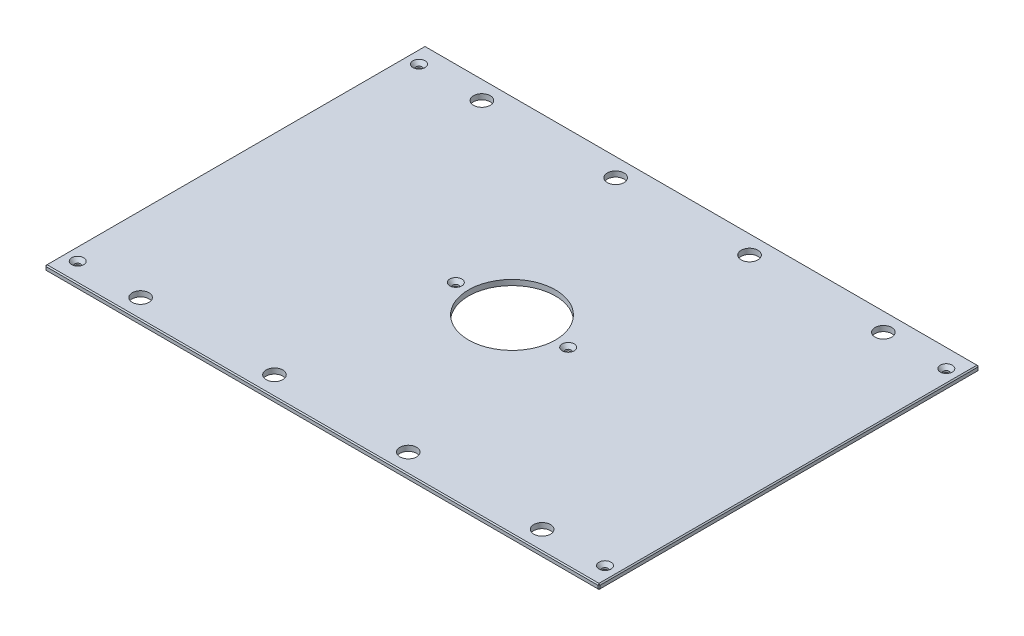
ISO-10303-21;
HEADER;
FILE_DESCRIPTION(('STEP AP214'),'2;1');
FILE_NAME('part.step','',(''),(''),'','','');
FILE_SCHEMA(('AUTOMOTIVE_DESIGN { 1 0 10303 214 1 1 1 1 }'));
ENDSEC;
DATA;
#1=APPLICATION_CONTEXT('core data for automotive mechanical design processes');
#2=APPLICATION_PROTOCOL_DEFINITION('international standard','automotive_design',2000,#1);
#3=PRODUCT_CONTEXT('',#1,'mechanical');
#4=PRODUCT('Part','Part','',(#3));
#5=PRODUCT_RELATED_PRODUCT_CATEGORY('part','',(#4));
#6=PRODUCT_DEFINITION_FORMATION('','',#4);
#7=PRODUCT_DEFINITION_CONTEXT('part definition',#1,'design');
#8=PRODUCT_DEFINITION('design','',#6,#7);
#9=PRODUCT_DEFINITION_SHAPE('','',#8);
#10=(LENGTH_UNIT() NAMED_UNIT(*) SI_UNIT(.MILLI.,.METRE.));
#11=(NAMED_UNIT(*) PLANE_ANGLE_UNIT() SI_UNIT($,.RADIAN.));
#12=(NAMED_UNIT(*) SI_UNIT($,.STERADIAN.) SOLID_ANGLE_UNIT());
#13=UNCERTAINTY_MEASURE_WITH_UNIT(LENGTH_MEASURE(1.E-05),#10,'distance_accuracy_value','');
#14=(GEOMETRIC_REPRESENTATION_CONTEXT(3) GLOBAL_UNCERTAINTY_ASSIGNED_CONTEXT((#13)) GLOBAL_UNIT_ASSIGNED_CONTEXT((#10,
#11,#12)) REPRESENTATION_CONTEXT('',''));
#15=CARTESIAN_POINT('',(0.,0.,0.));
#16=DIRECTION('',(0.,0.,1.));
#17=DIRECTION('',(1.,0.,0.));
#18=AXIS2_PLACEMENT_3D('',#15,#16,#17);
#19=CARTESIAN_POINT('',(-328.6125,6.35,-225.425));
#20=DIRECTION('',(1.,0.,0.));
#21=DIRECTION('',(0.,0.,-1.));
#22=AXIS2_PLACEMENT_3D('',#19,#20,#21);
#23=PLANE('',#22);
#24=DIRECTION('',(0.,0.,-1.));
#25=VECTOR('',#24,1.);
#26=CARTESIAN_POINT('',(-328.6125,5.08000000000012,-225.425));
#27=LINE('',#26,#25);
#28=CARTESIAN_POINT('',(-328.6125,5.08000000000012,224.155));
#29=VERTEX_POINT('',#28);
#30=CARTESIAN_POINT('',(-328.6125,5.08000000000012,-224.155));
#31=VERTEX_POINT('',#30);
#32=EDGE_CURVE('E135',#29,#31,#27,.T.);
#33=ORIENTED_EDGE('',*,*,#32,.T.);
#34=DIRECTION('',(0.,-1.,0.));
#35=VECTOR('',#34,1.);
#36=CARTESIAN_POINT('',(-328.6125,6.35,-224.155));
#37=LINE('',#36,#35);
#38=CARTESIAN_POINT('',(-328.6125,1.26999999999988,-224.155));
#39=VERTEX_POINT('',#38);
#40=EDGE_CURVE('E131',#31,#39,#37,.T.);
#41=ORIENTED_EDGE('',*,*,#40,.T.);
#42=DIRECTION('',(0.,0.,1.));
#43=VECTOR('',#42,1.);
#44=CARTESIAN_POINT('',(-328.6125,1.26999999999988,-225.425));
#45=LINE('',#44,#43);
#46=CARTESIAN_POINT('',(-328.6125,1.26999999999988,224.155));
#47=VERTEX_POINT('',#46);
#48=EDGE_CURVE('E126',#39,#47,#45,.T.);
#49=ORIENTED_EDGE('',*,*,#48,.T.);
#50=DIRECTION('',(0.,1.,0.));
#51=VECTOR('',#50,1.);
#52=CARTESIAN_POINT('',(-328.6125,6.35,224.155));
#53=LINE('',#52,#51);
#54=EDGE_CURVE('E128',#47,#29,#53,.T.);
#55=ORIENTED_EDGE('',*,*,#54,.T.);
#56=EDGE_LOOP('',(#33,#41,#49,#55));
#57=FACE_BOUND('',#56,.T.);
#58=ADVANCED_FACE('F35',(#57),#23,.F.);
#59=CARTESIAN_POINT('',(-328.6125,6.35,225.425));
#60=DIRECTION('',(0.,0.,-1.));
#61=DIRECTION('',(-1.,0.,0.));
#62=AXIS2_PLACEMENT_3D('',#59,#60,#61);
#63=PLANE('',#62);
#64=DIRECTION('',(1.,0.,0.));
#65=VECTOR('',#64,1.);
#66=CARTESIAN_POINT('',(-328.6125,1.26999999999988,225.425));
#67=LINE('',#66,#65);
#68=CARTESIAN_POINT('',(-327.3425,1.26999999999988,225.425));
#69=VERTEX_POINT('',#68);
#70=CARTESIAN_POINT('',(327.3425,1.26999999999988,225.425));
#71=VERTEX_POINT('',#70);
#72=EDGE_CURVE('E58',#69,#71,#67,.T.);
#73=ORIENTED_EDGE('',*,*,#72,.T.);
#74=DIRECTION('',(0.,1.,0.));
#75=VECTOR('',#74,1.);
#76=CARTESIAN_POINT('',(327.3425,6.35,225.425));
#77=LINE('',#76,#75);
#78=CARTESIAN_POINT('',(327.3425,5.08000000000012,225.425));
#79=VERTEX_POINT('',#78);
#80=EDGE_CURVE('E11',#71,#79,#77,.T.);
#81=ORIENTED_EDGE('',*,*,#80,.T.);
#82=DIRECTION('',(-1.,0.,0.));
#83=VECTOR('',#82,1.);
#84=CARTESIAN_POINT('',(-328.6125,5.08000000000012,225.425));
#85=LINE('',#84,#83);
#86=CARTESIAN_POINT('',(-327.3425,5.08000000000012,225.425));
#87=VERTEX_POINT('',#86);
#88=EDGE_CURVE('E44',#79,#87,#85,.T.);
#89=ORIENTED_EDGE('',*,*,#88,.T.);
#90=DIRECTION('',(0.,-1.,0.));
#91=VECTOR('',#90,1.);
#92=CARTESIAN_POINT('',(-327.3425,6.35,225.425));
#93=LINE('',#92,#91);
#94=EDGE_CURVE('E303',#87,#69,#93,.T.);
#95=ORIENTED_EDGE('',*,*,#94,.T.);
#96=EDGE_LOOP('',(#73,#81,#89,#95));
#97=FACE_BOUND('',#96,.T.);
#98=ADVANCED_FACE('F372',(#97),#63,.F.);
#99=CARTESIAN_POINT('',(328.6125,6.35,-225.425));
#100=DIRECTION('',(-1.,0.,0.));
#101=DIRECTION('',(0.,0.,1.));
#102=AXIS2_PLACEMENT_3D('',#99,#100,#101);
#103=PLANE('',#102);
#104=DIRECTION('',(0.,0.,-1.));
#105=VECTOR('',#104,1.);
#106=CARTESIAN_POINT('',(328.6125,1.26999999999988,-225.425));
#107=LINE('',#106,#105);
#108=CARTESIAN_POINT('',(328.6125,1.26999999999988,224.155));
#109=VERTEX_POINT('',#108);
#110=CARTESIAN_POINT('',(328.6125,1.26999999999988,-224.155));
#111=VERTEX_POINT('',#110);
#112=EDGE_CURVE('E298',#109,#111,#107,.T.);
#113=ORIENTED_EDGE('',*,*,#112,.T.);
#114=DIRECTION('',(0.,1.,0.));
#115=VECTOR('',#114,1.);
#116=CARTESIAN_POINT('',(328.6125,6.35,-224.155));
#117=LINE('',#116,#115);
#118=CARTESIAN_POINT('',(328.6125,5.08000000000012,-224.155));
#119=VERTEX_POINT('',#118);
#120=EDGE_CURVE('E300',#111,#119,#117,.T.);
#121=ORIENTED_EDGE('',*,*,#120,.T.);
#122=DIRECTION('',(0.,0.,1.));
#123=VECTOR('',#122,1.);
#124=CARTESIAN_POINT('',(328.6125,5.08000000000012,225.425));
#125=LINE('',#124,#123);
#126=CARTESIAN_POINT('',(328.6125,5.08000000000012,224.155));
#127=VERTEX_POINT('',#126);
#128=EDGE_CURVE('E296',#119,#127,#125,.T.);
#129=ORIENTED_EDGE('',*,*,#128,.T.);
#130=DIRECTION('',(0.,-1.,0.));
#131=VECTOR('',#130,1.);
#132=CARTESIAN_POINT('',(328.6125,6.35,224.155));
#133=LINE('',#132,#131);
#134=EDGE_CURVE('E294',#127,#109,#133,.T.);
#135=ORIENTED_EDGE('',*,*,#134,.T.);
#136=EDGE_LOOP('',(#113,#121,#129,#135));
#137=FACE_BOUND('',#136,.T.);
#138=ADVANCED_FACE('F359',(#137),#103,.F.);
#139=CARTESIAN_POINT('',(-328.6125,6.35,-225.425));
#140=DIRECTION('',(0.,0.,1.));
#141=DIRECTION('',(1.,0.,0.));
#142=AXIS2_PLACEMENT_3D('',#139,#140,#141);
#143=PLANE('',#142);
#144=DIRECTION('',(-1.,0.,0.));
#145=VECTOR('',#144,1.);
#146=CARTESIAN_POINT('',(-328.6125,1.26999999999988,-225.425));
#147=LINE('',#146,#145);
#148=CARTESIAN_POINT('',(327.3425,1.26999999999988,-225.425));
#149=VERTEX_POINT('',#148);
#150=CARTESIAN_POINT('',(-327.3425,1.26999999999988,-225.425));
#151=VERTEX_POINT('',#150);
#152=EDGE_CURVE('E270',#149,#151,#147,.T.);
#153=ORIENTED_EDGE('',*,*,#152,.T.);
#154=DIRECTION('',(0.,1.,0.));
#155=VECTOR('',#154,1.);
#156=CARTESIAN_POINT('',(-327.3425,6.35,-225.425));
#157=LINE('',#156,#155);
#158=CARTESIAN_POINT('',(-327.3425,5.08000000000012,-225.425));
#159=VERTEX_POINT('',#158);
#160=EDGE_CURVE('E274',#151,#159,#157,.T.);
#161=ORIENTED_EDGE('',*,*,#160,.T.);
#162=DIRECTION('',(1.,0.,0.));
#163=VECTOR('',#162,1.);
#164=CARTESIAN_POINT('',(328.6125,5.08000000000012,-225.425));
#165=LINE('',#164,#163);
#166=CARTESIAN_POINT('',(327.3425,5.08000000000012,-225.425));
#167=VERTEX_POINT('',#166);
#168=EDGE_CURVE('E272',#159,#167,#165,.T.);
#169=ORIENTED_EDGE('',*,*,#168,.T.);
#170=DIRECTION('',(0.,-1.,0.));
#171=VECTOR('',#170,1.);
#172=CARTESIAN_POINT('',(327.3425,6.35,-225.425));
#173=LINE('',#172,#171);
#174=EDGE_CURVE('E268',#167,#149,#173,.T.);
#175=ORIENTED_EDGE('',*,*,#174,.T.);
#176=EDGE_LOOP('',(#153,#161,#169,#175));
#177=FACE_BOUND('',#176,.T.);
#178=ADVANCED_FACE('F333',(#177),#143,.F.);
#179=CARTESIAN_POINT('',(0.,6.35,0.));
#180=DIRECTION('',(0.,1.,0.));
#181=DIRECTION('',(0.,0.,1.));
#182=AXIS2_PLACEMENT_3D('',#179,#180,#181);
#183=PLANE('',#182);
#184=CARTESIAN_POINT('',(312.7375,6.35,-202.40498));
#185=DIRECTION('',(0.,1.,0.));
#186=DIRECTION('',(0.,0.,1.));
#187=AXIS2_PLACEMENT_3D('',#184,#185,#186);
#188=CIRCLE('',#187,7.13740000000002);
#189=CARTESIAN_POINT('',(312.7375,6.35,-195.26758));
#190=VERTEX_POINT('',#189);
#191=EDGE_CURVE('E816',#190,#190,#188,.T.);
#192=ORIENTED_EDGE('',*,*,#191,.F.);
#193=EDGE_LOOP('',(#192));
#194=FACE_BOUND('',#193,.T.);
#195=CARTESIAN_POINT('',(312.7375,6.35,202.40498));
#196=DIRECTION('',(0.,1.,0.));
#197=DIRECTION('',(0.,0.,1.));
#198=AXIS2_PLACEMENT_3D('',#195,#196,#197);
#199=CIRCLE('',#198,7.13740000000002);
#200=CARTESIAN_POINT('',(312.7375,6.35,209.54238));
#201=VERTEX_POINT('',#200);
#202=EDGE_CURVE('E820',#201,#201,#199,.T.);
#203=ORIENTED_EDGE('',*,*,#202,.F.);
#204=EDGE_LOOP('',(#203));
#205=FACE_BOUND('',#204,.T.);
#206=CARTESIAN_POINT('',(-312.7375,6.35,202.40498));
#207=DIRECTION('',(0.,1.,0.));
#208=DIRECTION('',(0.,0.,1.));
#209=AXIS2_PLACEMENT_3D('',#206,#207,#208);
#210=CIRCLE('',#209,7.13740000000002);
#211=CARTESIAN_POINT('',(-312.7375,6.35,209.54238));
#212=VERTEX_POINT('',#211);
#213=EDGE_CURVE('E824',#212,#212,#210,.T.);
#214=ORIENTED_EDGE('',*,*,#213,.F.);
#215=EDGE_LOOP('',(#214));
#216=FACE_BOUND('',#215,.T.);
#217=CARTESIAN_POINT('',(-66.675,6.35,0.));
#218=DIRECTION('',(0.,1.,0.));
#219=DIRECTION('',(0.,0.,1.));
#220=AXIS2_PLACEMENT_3D('',#217,#218,#219);
#221=CIRCLE('',#220,7.1374);
#222=CARTESIAN_POINT('',(-66.675,6.35,7.1374));
#223=VERTEX_POINT('',#222);
#224=EDGE_CURVE('E828',#223,#223,#221,.T.);
#225=ORIENTED_EDGE('',*,*,#224,.F.);
#226=EDGE_LOOP('',(#225));
#227=FACE_BOUND('',#226,.T.);
#228=CARTESIAN_POINT('',(66.675,6.35,0.));
#229=DIRECTION('',(0.,1.,0.));
#230=DIRECTION('',(0.,0.,1.));
#231=AXIS2_PLACEMENT_3D('',#228,#229,#230);
#232=CIRCLE('',#231,7.1374);
#233=CARTESIAN_POINT('',(66.675,6.35,7.1374));
#234=VERTEX_POINT('',#233);
#235=EDGE_CURVE('E832',#234,#234,#232,.T.);
#236=ORIENTED_EDGE('',*,*,#235,.F.);
#237=EDGE_LOOP('',(#236));
#238=FACE_BOUND('',#237,.T.);
#239=CARTESIAN_POINT('',(-312.7375,6.35,-202.40498));
#240=DIRECTION('',(0.,1.,0.));
#241=DIRECTION('',(0.,0.,1.));
#242=AXIS2_PLACEMENT_3D('',#239,#240,#241);
#243=CIRCLE('',#242,7.13740000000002);
#244=CARTESIAN_POINT('',(-312.7375,6.35,-195.26758));
#245=VERTEX_POINT('',#244);
#246=EDGE_CURVE('E835',#245,#245,#243,.T.);
#247=ORIENTED_EDGE('',*,*,#246,.F.);
#248=EDGE_LOOP('',(#247));
#249=FACE_BOUND('',#248,.T.);
#250=DIRECTION('',(0.,0.,-1.));
#251=VECTOR('',#250,1.);
#252=CARTESIAN_POINT('',(327.3425,6.35,-225.425));
#253=LINE('',#252,#251);
#254=CARTESIAN_POINT('',(327.3425,6.35,224.155));
#255=VERTEX_POINT('',#254);
#256=CARTESIAN_POINT('',(327.3425,6.35,-224.155));
#257=VERTEX_POINT('',#256);
#258=EDGE_CURVE('E281',#255,#257,#253,.T.);
#259=ORIENTED_EDGE('',*,*,#258,.T.);
#260=DIRECTION('',(-1.,0.,0.));
#261=VECTOR('',#260,1.);
#262=CARTESIAN_POINT('',(-328.6125,6.35,-224.155));
#263=LINE('',#262,#261);
#264=CARTESIAN_POINT('',(-327.3425,6.35,-224.155));
#265=VERTEX_POINT('',#264);
#266=EDGE_CURVE('E283',#257,#265,#263,.T.);
#267=ORIENTED_EDGE('',*,*,#266,.T.);
#268=DIRECTION('',(0.,0.,1.));
#269=VECTOR('',#268,1.);
#270=CARTESIAN_POINT('',(-327.3425,6.35,225.425));
#271=LINE('',#270,#269);
#272=CARTESIAN_POINT('',(-327.3425,6.35,224.155));
#273=VERTEX_POINT('',#272);
#274=EDGE_CURVE('E279',#265,#273,#271,.T.);
#275=ORIENTED_EDGE('',*,*,#274,.T.);
#276=DIRECTION('',(1.,0.,0.));
#277=VECTOR('',#276,1.);
#278=CARTESIAN_POINT('',(328.6125,6.35,224.155));
#279=LINE('',#278,#277);
#280=EDGE_CURVE('E277',#273,#255,#279,.T.);
#281=ORIENTED_EDGE('',*,*,#280,.T.);
#282=EDGE_LOOP('',(#259,#267,#275,#281));
#283=FACE_BOUND('',#282,.T.);
#284=CARTESIAN_POINT('',(238.125,6.35,-202.40498));
#285=DIRECTION('',(0.,1.,0.));
#286=DIRECTION('',(0.,0.,1.));
#287=AXIS2_PLACEMENT_3D('',#284,#285,#286);
#288=CIRCLE('',#287,9.921875);
#289=CARTESIAN_POINT('',(238.125,6.35,-192.483105));
#290=VERTEX_POINT('',#289);
#291=EDGE_CURVE('E204',#290,#290,#288,.T.);
#292=ORIENTED_EDGE('',*,*,#291,.F.);
#293=EDGE_LOOP('',(#292));
#294=FACE_BOUND('',#293,.T.);
#295=CARTESIAN_POINT('',(-238.125,6.35,-202.40498));
#296=DIRECTION('',(0.,1.,0.));
#297=DIRECTION('',(0.,0.,1.));
#298=AXIS2_PLACEMENT_3D('',#295,#296,#297);
#299=CIRCLE('',#298,9.921875);
#300=CARTESIAN_POINT('',(-238.125,6.35,-192.483105));
#301=VERTEX_POINT('',#300);
#302=EDGE_CURVE('E214',#301,#301,#299,.T.);
#303=ORIENTED_EDGE('',*,*,#302,.F.);
#304=EDGE_LOOP('',(#303));
#305=FACE_BOUND('',#304,.T.);
#306=CARTESIAN_POINT('',(238.125,6.35,202.40498));
#307=DIRECTION('',(0.,1.,0.));
#308=DIRECTION('',(0.,0.,1.));
#309=AXIS2_PLACEMENT_3D('',#306,#307,#308);
#310=CIRCLE('',#309,9.921875);
#311=CARTESIAN_POINT('',(238.125,6.35,212.326855));
#312=VERTEX_POINT('',#311);
#313=EDGE_CURVE('E225',#312,#312,#310,.T.);
#314=ORIENTED_EDGE('',*,*,#313,.F.);
#315=EDGE_LOOP('',(#314));
#316=FACE_BOUND('',#315,.T.);
#317=CARTESIAN_POINT('',(-238.125,6.35,202.40498));
#318=DIRECTION('',(0.,1.,0.));
#319=DIRECTION('',(0.,0.,1.));
#320=AXIS2_PLACEMENT_3D('',#317,#318,#319);
#321=CIRCLE('',#320,9.921875);
#322=CARTESIAN_POINT('',(-238.125,6.35,212.326855));
#323=VERTEX_POINT('',#322);
#324=EDGE_CURVE('E231',#323,#323,#321,.T.);
#325=ORIENTED_EDGE('',*,*,#324,.F.);
#326=EDGE_LOOP('',(#325));
#327=FACE_BOUND('',#326,.T.);
#328=CARTESIAN_POINT('',(-79.375,6.35,-202.40498));
#329=DIRECTION('',(0.,1.,0.));
#330=DIRECTION('',(0.,0.,1.));
#331=AXIS2_PLACEMENT_3D('',#328,#329,#330);
#332=CIRCLE('',#331,9.921875);
#333=CARTESIAN_POINT('',(-79.375,6.35,-192.483105));
#334=VERTEX_POINT('',#333);
#335=EDGE_CURVE('E237',#334,#334,#332,.T.);
#336=ORIENTED_EDGE('',*,*,#335,.F.);
#337=EDGE_LOOP('',(#336));
#338=FACE_BOUND('',#337,.T.);
#339=CARTESIAN_POINT('',(79.375,6.35,-202.40498));
#340=DIRECTION('',(0.,1.,0.));
#341=DIRECTION('',(0.,0.,1.));
#342=AXIS2_PLACEMENT_3D('',#339,#340,#341);
#343=CIRCLE('',#342,9.921875);
#344=CARTESIAN_POINT('',(79.375,6.35,-192.483105));
#345=VERTEX_POINT('',#344);
#346=EDGE_CURVE('E243',#345,#345,#343,.T.);
#347=ORIENTED_EDGE('',*,*,#346,.F.);
#348=EDGE_LOOP('',(#347));
#349=FACE_BOUND('',#348,.T.);
#350=CARTESIAN_POINT('',(79.375,6.35,202.40498));
#351=DIRECTION('',(0.,1.,0.));
#352=DIRECTION('',(0.,0.,1.));
#353=AXIS2_PLACEMENT_3D('',#350,#351,#352);
#354=CIRCLE('',#353,9.921875);
#355=CARTESIAN_POINT('',(79.375,6.35,212.326855));
#356=VERTEX_POINT('',#355);
#357=EDGE_CURVE('E249',#356,#356,#354,.T.);
#358=ORIENTED_EDGE('',*,*,#357,.F.);
#359=EDGE_LOOP('',(#358));
#360=FACE_BOUND('',#359,.T.);
#361=CARTESIAN_POINT('',(-79.375,6.35,202.40498));
#362=DIRECTION('',(0.,1.,0.));
#363=DIRECTION('',(0.,0.,1.));
#364=AXIS2_PLACEMENT_3D('',#361,#362,#363);
#365=CIRCLE('',#364,9.921875);
#366=CARTESIAN_POINT('',(-79.375,6.35,212.326855));
#367=VERTEX_POINT('',#366);
#368=EDGE_CURVE('E255',#367,#367,#365,.T.);
#369=ORIENTED_EDGE('',*,*,#368,.F.);
#370=EDGE_LOOP('',(#369));
#371=FACE_BOUND('',#370,.T.);
#372=CARTESIAN_POINT('',(0.,6.35,0.));
#373=DIRECTION('',(0.,1.,0.));
#374=DIRECTION('',(0.,0.,1.));
#375=AXIS2_PLACEMENT_3D('',#372,#373,#374);
#376=CIRCLE('',#375,51.562);
#377=CARTESIAN_POINT('',(0.,6.35,51.562));
#378=VERTEX_POINT('',#377);
#379=EDGE_CURVE('E261',#378,#378,#376,.T.);
#380=ORIENTED_EDGE('',*,*,#379,.F.);
#381=EDGE_LOOP('',(#380));
#382=FACE_BOUND('',#381,.T.);
#383=ADVANCED_FACE('F381',(#194,#205,#216,#227,#238,#249,#283,#294,#305,#316,#327,#338,#349,
#360,#371,#382),#183,.T.);
#384=CARTESIAN_POINT('',(0.,0.,0.));
#385=DIRECTION('',(0.,1.,0.));
#386=DIRECTION('',(0.,0.,1.));
#387=AXIS2_PLACEMENT_3D('',#384,#385,#386);
#388=PLANE('',#387);
#389=CARTESIAN_POINT('',(312.7375,0.,-202.40498));
#390=DIRECTION('',(0.,1.,0.));
#391=DIRECTION('',(0.,0.,1.));
#392=AXIS2_PLACEMENT_3D('',#389,#390,#391);
#393=CIRCLE('',#392,3.3782);
#394=CARTESIAN_POINT('',(312.7375,0.,-199.02678));
#395=VERTEX_POINT('',#394);
#396=EDGE_CURVE('E869',#395,#395,#393,.T.);
#397=ORIENTED_EDGE('',*,*,#396,.T.);
#398=EDGE_LOOP('',(#397));
#399=FACE_BOUND('',#398,.T.);
#400=CARTESIAN_POINT('',(312.7375,0.,202.40498));
#401=DIRECTION('',(0.,1.,0.));
#402=DIRECTION('',(0.,0.,1.));
#403=AXIS2_PLACEMENT_3D('',#400,#401,#402);
#404=CIRCLE('',#403,3.3782);
#405=CARTESIAN_POINT('',(312.7375,0.,205.78318));
#406=VERTEX_POINT('',#405);
#407=EDGE_CURVE('E862',#406,#406,#404,.T.);
#408=ORIENTED_EDGE('',*,*,#407,.T.);
#409=EDGE_LOOP('',(#408));
#410=FACE_BOUND('',#409,.T.);
#411=CARTESIAN_POINT('',(-312.7375,0.,202.40498));
#412=DIRECTION('',(0.,1.,0.));
#413=DIRECTION('',(0.,0.,1.));
#414=AXIS2_PLACEMENT_3D('',#411,#412,#413);
#415=CIRCLE('',#414,3.3782);
#416=CARTESIAN_POINT('',(-312.7375,0.,205.78318));
#417=VERTEX_POINT('',#416);
#418=EDGE_CURVE('E855',#417,#417,#415,.T.);
#419=ORIENTED_EDGE('',*,*,#418,.T.);
#420=EDGE_LOOP('',(#419));
#421=FACE_BOUND('',#420,.T.);
#422=CARTESIAN_POINT('',(-66.675,0.,0.));
#423=DIRECTION('',(0.,1.,0.));
#424=DIRECTION('',(0.,0.,1.));
#425=AXIS2_PLACEMENT_3D('',#422,#423,#424);
#426=CIRCLE('',#425,3.3782);
#427=CARTESIAN_POINT('',(-66.675,0.,3.3782));
#428=VERTEX_POINT('',#427);
#429=EDGE_CURVE('E848',#428,#428,#426,.T.);
#430=ORIENTED_EDGE('',*,*,#429,.T.);
#431=EDGE_LOOP('',(#430));
#432=FACE_BOUND('',#431,.T.);
#433=CARTESIAN_POINT('',(66.675,0.,0.));
#434=DIRECTION('',(0.,1.,0.));
#435=DIRECTION('',(0.,0.,1.));
#436=AXIS2_PLACEMENT_3D('',#433,#434,#435);
#437=CIRCLE('',#436,3.3782);
#438=CARTESIAN_POINT('',(66.675,0.,3.3782));
#439=VERTEX_POINT('',#438);
#440=EDGE_CURVE('E838',#439,#439,#437,.T.);
#441=ORIENTED_EDGE('',*,*,#440,.T.);
#442=EDGE_LOOP('',(#441));
#443=FACE_BOUND('',#442,.T.);
#444=CARTESIAN_POINT('',(-312.7375,0.,-202.40498));
#445=DIRECTION('',(0.,1.,0.));
#446=DIRECTION('',(0.,0.,1.));
#447=AXIS2_PLACEMENT_3D('',#444,#445,#446);
#448=CIRCLE('',#447,3.3782);
#449=CARTESIAN_POINT('',(-312.7375,0.,-199.02678));
#450=VERTEX_POINT('',#449);
#451=EDGE_CURVE('E217',#450,#450,#448,.T.);
#452=ORIENTED_EDGE('',*,*,#451,.T.);
#453=EDGE_LOOP('',(#452));
#454=FACE_BOUND('',#453,.T.);
#455=DIRECTION('',(0.,0.,-1.));
#456=VECTOR('',#455,1.);
#457=CARTESIAN_POINT('',(-327.3425,0.,0.));
#458=LINE('',#457,#456);
#459=CARTESIAN_POINT('',(-327.3425,0.,224.155));
#460=VERTEX_POINT('',#459);
#461=CARTESIAN_POINT('',(-327.3425,0.,-224.155));
#462=VERTEX_POINT('',#461);
#463=EDGE_CURVE('E158',#460,#462,#458,.T.);
#464=ORIENTED_EDGE('',*,*,#463,.T.);
#465=DIRECTION('',(1.,0.,0.));
#466=VECTOR('',#465,1.);
#467=CARTESIAN_POINT('',(0.,0.,-224.155));
#468=LINE('',#467,#466);
#469=CARTESIAN_POINT('',(327.3425,0.,-224.155));
#470=VERTEX_POINT('',#469);
#471=EDGE_CURVE('E291',#462,#470,#468,.T.);
#472=ORIENTED_EDGE('',*,*,#471,.T.);
#473=DIRECTION('',(0.,0.,1.));
#474=VECTOR('',#473,1.);
#475=CARTESIAN_POINT('',(327.3425,0.,0.));
#476=LINE('',#475,#474);
#477=CARTESIAN_POINT('',(327.3425,0.,224.155));
#478=VERTEX_POINT('',#477);
#479=EDGE_CURVE('E289',#470,#478,#476,.T.);
#480=ORIENTED_EDGE('',*,*,#479,.T.);
#481=DIRECTION('',(-1.,0.,0.));
#482=VECTOR('',#481,1.);
#483=CARTESIAN_POINT('',(0.,0.,224.155));
#484=LINE('',#483,#482);
#485=EDGE_CURVE('E286',#478,#460,#484,.T.);
#486=ORIENTED_EDGE('',*,*,#485,.T.);
#487=EDGE_LOOP('',(#464,#472,#480,#486));
#488=FACE_BOUND('',#487,.T.);
#489=CARTESIAN_POINT('',(238.125,0.,-202.40498));
#490=DIRECTION('',(0.,1.,0.));
#491=DIRECTION('',(0.,0.,1.));
#492=AXIS2_PLACEMENT_3D('',#489,#490,#491);
#493=CIRCLE('',#492,9.921875);
#494=CARTESIAN_POINT('',(238.125,0.,-192.483105));
#495=VERTEX_POINT('',#494);
#496=EDGE_CURVE('E209',#495,#495,#493,.T.);
#497=ORIENTED_EDGE('',*,*,#496,.T.);
#498=EDGE_LOOP('',(#497));
#499=FACE_BOUND('',#498,.T.);
#500=CARTESIAN_POINT('',(-238.125,0.,-202.40498));
#501=DIRECTION('',(0.,1.,0.));
#502=DIRECTION('',(0.,0.,1.));
#503=AXIS2_PLACEMENT_3D('',#500,#501,#502);
#504=CIRCLE('',#503,9.921875);
#505=CARTESIAN_POINT('',(-238.125,0.,-192.483105));
#506=VERTEX_POINT('',#505);
#507=EDGE_CURVE('E222',#506,#506,#504,.T.);
#508=ORIENTED_EDGE('',*,*,#507,.T.);
#509=EDGE_LOOP('',(#508));
#510=FACE_BOUND('',#509,.T.);
#511=CARTESIAN_POINT('',(238.125,0.,202.40498));
#512=DIRECTION('',(0.,1.,0.));
#513=DIRECTION('',(0.,0.,1.));
#514=AXIS2_PLACEMENT_3D('',#511,#512,#513);
#515=CIRCLE('',#514,9.921875);
#516=CARTESIAN_POINT('',(238.125,0.,212.326855));
#517=VERTEX_POINT('',#516);
#518=EDGE_CURVE('E228',#517,#517,#515,.T.);
#519=ORIENTED_EDGE('',*,*,#518,.T.);
#520=EDGE_LOOP('',(#519));
#521=FACE_BOUND('',#520,.T.);
#522=CARTESIAN_POINT('',(-238.125,0.,202.40498));
#523=DIRECTION('',(0.,1.,0.));
#524=DIRECTION('',(0.,0.,1.));
#525=AXIS2_PLACEMENT_3D('',#522,#523,#524);
#526=CIRCLE('',#525,9.921875);
#527=CARTESIAN_POINT('',(-238.125,0.,212.326855));
#528=VERTEX_POINT('',#527);
#529=EDGE_CURVE('E234',#528,#528,#526,.T.);
#530=ORIENTED_EDGE('',*,*,#529,.T.);
#531=EDGE_LOOP('',(#530));
#532=FACE_BOUND('',#531,.T.);
#533=CARTESIAN_POINT('',(-79.375,0.,-202.40498));
#534=DIRECTION('',(0.,1.,0.));
#535=DIRECTION('',(0.,0.,1.));
#536=AXIS2_PLACEMENT_3D('',#533,#534,#535);
#537=CIRCLE('',#536,9.921875);
#538=CARTESIAN_POINT('',(-79.375,0.,-192.483105));
#539=VERTEX_POINT('',#538);
#540=EDGE_CURVE('E240',#539,#539,#537,.T.);
#541=ORIENTED_EDGE('',*,*,#540,.T.);
#542=EDGE_LOOP('',(#541));
#543=FACE_BOUND('',#542,.T.);
#544=CARTESIAN_POINT('',(79.375,0.,-202.40498));
#545=DIRECTION('',(0.,1.,0.));
#546=DIRECTION('',(0.,0.,1.));
#547=AXIS2_PLACEMENT_3D('',#544,#545,#546);
#548=CIRCLE('',#547,9.921875);
#549=CARTESIAN_POINT('',(79.375,0.,-192.483105));
#550=VERTEX_POINT('',#549);
#551=EDGE_CURVE('E246',#550,#550,#548,.T.);
#552=ORIENTED_EDGE('',*,*,#551,.T.);
#553=EDGE_LOOP('',(#552));
#554=FACE_BOUND('',#553,.T.);
#555=CARTESIAN_POINT('',(79.375,0.,202.40498));
#556=DIRECTION('',(0.,1.,0.));
#557=DIRECTION('',(0.,0.,1.));
#558=AXIS2_PLACEMENT_3D('',#555,#556,#557);
#559=CIRCLE('',#558,9.921875);
#560=CARTESIAN_POINT('',(79.375,0.,212.326855));
#561=VERTEX_POINT('',#560);
#562=EDGE_CURVE('E252',#561,#561,#559,.T.);
#563=ORIENTED_EDGE('',*,*,#562,.T.);
#564=EDGE_LOOP('',(#563));
#565=FACE_BOUND('',#564,.T.);
#566=CARTESIAN_POINT('',(-79.375,0.,202.40498));
#567=DIRECTION('',(0.,1.,0.));
#568=DIRECTION('',(0.,0.,1.));
#569=AXIS2_PLACEMENT_3D('',#566,#567,#568);
#570=CIRCLE('',#569,9.921875);
#571=CARTESIAN_POINT('',(-79.375,0.,212.326855));
#572=VERTEX_POINT('',#571);
#573=EDGE_CURVE('E258',#572,#572,#570,.T.);
#574=ORIENTED_EDGE('',*,*,#573,.T.);
#575=EDGE_LOOP('',(#574));
#576=FACE_BOUND('',#575,.T.);
#577=CARTESIAN_POINT('',(0.,0.,0.));
#578=DIRECTION('',(0.,1.,0.));
#579=DIRECTION('',(0.,0.,1.));
#580=AXIS2_PLACEMENT_3D('',#577,#578,#579);
#581=CIRCLE('',#580,51.562);
#582=CARTESIAN_POINT('',(0.,0.,51.562));
#583=VERTEX_POINT('',#582);
#584=EDGE_CURVE('E147',#583,#583,#581,.T.);
#585=ORIENTED_EDGE('',*,*,#584,.T.);
#586=EDGE_LOOP('',(#585));
#587=FACE_BOUND('',#586,.T.);
#588=ADVANCED_FACE('F346',(#399,#410,#421,#432,#443,#454,#488,#499,#510,#521,#532,#543,#554,
#565,#576,#587),#388,.F.);
#589=CARTESIAN_POINT('',(0.,0.,0.));
#590=DIRECTION('',(0.,1.,0.));
#591=DIRECTION('',(0.,0.,1.));
#592=AXIS2_PLACEMENT_3D('',#589,#590,#591);
#593=CYLINDRICAL_SURFACE('',#592,51.562);
#594=ORIENTED_EDGE('',*,*,#584,.F.);
#595=EDGE_LOOP('',(#594));
#596=FACE_BOUND('',#595,.T.);
#597=ORIENTED_EDGE('',*,*,#379,.T.);
#598=EDGE_LOOP('',(#597));
#599=FACE_BOUND('',#598,.T.);
#600=ADVANCED_FACE('F751',(#596,#599),#593,.F.);
#601=CARTESIAN_POINT('',(-79.375,6.35,202.40498));
#602=DIRECTION('',(0.,1.,0.));
#603=DIRECTION('',(0.,0.,1.));
#604=AXIS2_PLACEMENT_3D('',#601,#602,#603);
#605=CYLINDRICAL_SURFACE('',#604,9.921875);
#606=ORIENTED_EDGE('',*,*,#573,.F.);
#607=EDGE_LOOP('',(#606));
#608=FACE_BOUND('',#607,.T.);
#609=ORIENTED_EDGE('',*,*,#368,.T.);
#610=EDGE_LOOP('',(#609));
#611=FACE_BOUND('',#610,.T.);
#612=ADVANCED_FACE('F742',(#608,#611),#605,.F.);
#613=CARTESIAN_POINT('',(79.375,6.35,202.40498));
#614=DIRECTION('',(0.,1.,0.));
#615=DIRECTION('',(0.,0.,1.));
#616=AXIS2_PLACEMENT_3D('',#613,#614,#615);
#617=CYLINDRICAL_SURFACE('',#616,9.921875);
#618=ORIENTED_EDGE('',*,*,#562,.F.);
#619=EDGE_LOOP('',(#618));
#620=FACE_BOUND('',#619,.T.);
#621=ORIENTED_EDGE('',*,*,#357,.T.);
#622=EDGE_LOOP('',(#621));
#623=FACE_BOUND('',#622,.T.);
#624=ADVANCED_FACE('F733',(#620,#623),#617,.F.);
#625=CARTESIAN_POINT('',(79.375,6.35,-202.40498));
#626=DIRECTION('',(0.,1.,0.));
#627=DIRECTION('',(0.,0.,1.));
#628=AXIS2_PLACEMENT_3D('',#625,#626,#627);
#629=CYLINDRICAL_SURFACE('',#628,9.921875);
#630=ORIENTED_EDGE('',*,*,#551,.F.);
#631=EDGE_LOOP('',(#630));
#632=FACE_BOUND('',#631,.T.);
#633=ORIENTED_EDGE('',*,*,#346,.T.);
#634=EDGE_LOOP('',(#633));
#635=FACE_BOUND('',#634,.T.);
#636=ADVANCED_FACE('F724',(#632,#635),#629,.F.);
#637=CARTESIAN_POINT('',(-79.375,6.35,-202.40498));
#638=DIRECTION('',(0.,1.,0.));
#639=DIRECTION('',(0.,0.,1.));
#640=AXIS2_PLACEMENT_3D('',#637,#638,#639);
#641=CYLINDRICAL_SURFACE('',#640,9.921875);
#642=ORIENTED_EDGE('',*,*,#540,.F.);
#643=EDGE_LOOP('',(#642));
#644=FACE_BOUND('',#643,.T.);
#645=ORIENTED_EDGE('',*,*,#335,.T.);
#646=EDGE_LOOP('',(#645));
#647=FACE_BOUND('',#646,.T.);
#648=ADVANCED_FACE('F715',(#644,#647),#641,.F.);
#649=CARTESIAN_POINT('',(-238.125,6.35,202.40498));
#650=DIRECTION('',(0.,1.,0.));
#651=DIRECTION('',(0.,0.,1.));
#652=AXIS2_PLACEMENT_3D('',#649,#650,#651);
#653=CYLINDRICAL_SURFACE('',#652,9.921875);
#654=ORIENTED_EDGE('',*,*,#529,.F.);
#655=EDGE_LOOP('',(#654));
#656=FACE_BOUND('',#655,.T.);
#657=ORIENTED_EDGE('',*,*,#324,.T.);
#658=EDGE_LOOP('',(#657));
#659=FACE_BOUND('',#658,.T.);
#660=ADVANCED_FACE('F706',(#656,#659),#653,.F.);
#661=CARTESIAN_POINT('',(238.125,6.35,202.40498));
#662=DIRECTION('',(0.,1.,0.));
#663=DIRECTION('',(0.,0.,1.));
#664=AXIS2_PLACEMENT_3D('',#661,#662,#663);
#665=CYLINDRICAL_SURFACE('',#664,9.921875);
#666=ORIENTED_EDGE('',*,*,#518,.F.);
#667=EDGE_LOOP('',(#666));
#668=FACE_BOUND('',#667,.T.);
#669=ORIENTED_EDGE('',*,*,#313,.T.);
#670=EDGE_LOOP('',(#669));
#671=FACE_BOUND('',#670,.T.);
#672=ADVANCED_FACE('F697',(#668,#671),#665,.F.);
#673=CARTESIAN_POINT('',(-238.125,6.35,-202.40498));
#674=DIRECTION('',(0.,1.,0.));
#675=DIRECTION('',(0.,0.,1.));
#676=AXIS2_PLACEMENT_3D('',#673,#674,#675);
#677=CYLINDRICAL_SURFACE('',#676,9.921875);
#678=ORIENTED_EDGE('',*,*,#507,.F.);
#679=EDGE_LOOP('',(#678));
#680=FACE_BOUND('',#679,.T.);
#681=ORIENTED_EDGE('',*,*,#302,.T.);
#682=EDGE_LOOP('',(#681));
#683=FACE_BOUND('',#682,.T.);
#684=ADVANCED_FACE('F687',(#680,#683),#677,.F.);
#685=CARTESIAN_POINT('',(238.125,6.35,-202.40498));
#686=DIRECTION('',(0.,1.,0.));
#687=DIRECTION('',(0.,0.,1.));
#688=AXIS2_PLACEMENT_3D('',#685,#686,#687);
#689=CYLINDRICAL_SURFACE('',#688,9.921875);
#690=ORIENTED_EDGE('',*,*,#496,.F.);
#691=EDGE_LOOP('',(#690));
#692=FACE_BOUND('',#691,.T.);
#693=ORIENTED_EDGE('',*,*,#291,.T.);
#694=EDGE_LOOP('',(#693));
#695=FACE_BOUND('',#694,.T.);
#696=ADVANCED_FACE('F390',(#692,#695),#689,.F.);
#697=CARTESIAN_POINT('',(328.6125,6.35,224.155));
#698=DIRECTION('',(-0.707106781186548,0.,-0.707106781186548));
#699=DIRECTION('',(0.,-1.,0.));
#700=AXIS2_PLACEMENT_3D('',#697,#698,#699);
#701=PLANE('',#700);
#702=DIRECTION('',(-0.707106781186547,0.,0.707106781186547));
#703=VECTOR('',#702,1.);
#704=CARTESIAN_POINT('',(328.6125,5.08000000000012,224.155));
#705=LINE('',#704,#703);
#706=EDGE_CURVE('E39',#79,#127,#705,.F.);
#707=ORIENTED_EDGE('',*,*,#706,.F.);
#708=ORIENTED_EDGE('',*,*,#80,.F.);
#709=DIRECTION('',(0.707106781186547,0.,-0.707106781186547));
#710=VECTOR('',#709,1.);
#711=CARTESIAN_POINT('',(327.9775,1.26999999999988,224.79));
#712=LINE('',#711,#710);
#713=EDGE_CURVE('E197',#109,#71,#712,.F.);
#714=ORIENTED_EDGE('',*,*,#713,.F.);
#715=ORIENTED_EDGE('',*,*,#134,.F.);
#716=EDGE_LOOP('',(#707,#708,#714,#715));
#717=FACE_BOUND('',#716,.T.);
#718=ADVANCED_FACE('F37',(#717),#701,.F.);
#719=CARTESIAN_POINT('',(328.6125,5.08000000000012,224.155));
#720=DIRECTION('',(0.577350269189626,0.577350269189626,0.577350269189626));
#721=DIRECTION('',(0.707106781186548,0.,-0.707106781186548));
#722=AXIS2_PLACEMENT_3D('',#719,#720,#721);
#723=PLANE('',#722);
#724=DIRECTION('',(0.,-0.707106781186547,0.707106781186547));
#725=VECTOR('',#724,1.);
#726=CARTESIAN_POINT('',(327.3425,5.71500000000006,224.79));
#727=LINE('',#726,#725);
#728=EDGE_CURVE('E193',#79,#255,#727,.F.);
#729=ORIENTED_EDGE('',*,*,#728,.F.);
#730=ORIENTED_EDGE('',*,*,#706,.T.);
#731=DIRECTION('',(-0.707106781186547,0.707106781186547,0.));
#732=VECTOR('',#731,1.);
#733=CARTESIAN_POINT('',(328.6125,5.08000000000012,224.155));
#734=LINE('',#733,#732);
#735=EDGE_CURVE('E195',#255,#127,#734,.F.);
#736=ORIENTED_EDGE('',*,*,#735,.F.);
#737=EDGE_LOOP('',(#729,#730,#736));
#738=FACE_BOUND('',#737,.T.);
#739=ADVANCED_FACE('F383',(#738),#723,.T.);
#740=CARTESIAN_POINT('',(327.3425,0.,224.155));
#741=DIRECTION('',(0.577350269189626,-0.577350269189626,0.577350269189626));
#742=DIRECTION('',(0.707106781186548,0.,-0.707106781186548));
#743=AXIS2_PLACEMENT_3D('',#740,#741,#742);
#744=PLANE('',#743);
#745=DIRECTION('',(-0.707106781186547,-0.707106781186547,0.));
#746=VECTOR('',#745,1.);
#747=CARTESIAN_POINT('',(327.3425,0.,224.155));
#748=LINE('',#747,#746);
#749=EDGE_CURVE('E187',#109,#478,#748,.T.);
#750=ORIENTED_EDGE('',*,*,#749,.F.);
#751=ORIENTED_EDGE('',*,*,#713,.T.);
#752=DIRECTION('',(0.,0.707106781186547,0.707106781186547));
#753=VECTOR('',#752,1.);
#754=CARTESIAN_POINT('',(327.3425,0.,224.155));
#755=LINE('',#754,#753);
#756=EDGE_CURVE('E190',#478,#71,#755,.T.);
#757=ORIENTED_EDGE('',*,*,#756,.F.);
#758=EDGE_LOOP('',(#750,#751,#757));
#759=FACE_BOUND('',#758,.T.);
#760=ADVANCED_FACE('F352',(#759),#744,.T.);
#761=CARTESIAN_POINT('',(327.3425,6.35,0.));
#762=DIRECTION('',(0.707106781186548,0.707106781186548,0.));
#763=DIRECTION('',(0.,0.,1.));
#764=AXIS2_PLACEMENT_3D('',#761,#762,#763);
#765=PLANE('',#764);
#766=ORIENTED_EDGE('',*,*,#735,.T.);
#767=ORIENTED_EDGE('',*,*,#128,.F.);
#768=DIRECTION('',(0.707106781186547,-0.707106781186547,0.));
#769=VECTOR('',#768,1.);
#770=CARTESIAN_POINT('',(327.9775,5.71500000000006,-224.155));
#771=LINE('',#770,#769);
#772=EDGE_CURVE('E182',#257,#119,#771,.T.);
#773=ORIENTED_EDGE('',*,*,#772,.F.);
#774=ORIENTED_EDGE('',*,*,#258,.F.);
#775=EDGE_LOOP('',(#766,#767,#773,#774));
#776=FACE_BOUND('',#775,.T.);
#777=ADVANCED_FACE('F369',(#776),#765,.T.);
#778=CARTESIAN_POINT('',(0.,6.35,224.155));
#779=DIRECTION('',(0.,0.707106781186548,0.707106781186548));
#780=DIRECTION('',(-1.,0.,0.));
#781=AXIS2_PLACEMENT_3D('',#778,#779,#780);
#782=PLANE('',#781);
#783=ORIENTED_EDGE('',*,*,#728,.T.);
#784=ORIENTED_EDGE('',*,*,#280,.F.);
#785=DIRECTION('',(0.,0.707106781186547,-0.707106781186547));
#786=VECTOR('',#785,1.);
#787=CARTESIAN_POINT('',(-327.3425,6.35,224.155));
#788=LINE('',#787,#786);
#789=EDGE_CURVE('E179',#87,#273,#788,.T.);
#790=ORIENTED_EDGE('',*,*,#789,.F.);
#791=ORIENTED_EDGE('',*,*,#88,.F.);
#792=EDGE_LOOP('',(#783,#784,#790,#791));
#793=FACE_BOUND('',#792,.T.);
#794=ADVANCED_FACE('F374',(#793),#782,.T.);
#795=CARTESIAN_POINT('',(-327.3425,6.35,225.425));
#796=DIRECTION('',(0.707106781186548,0.,-0.707106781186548));
#797=DIRECTION('',(0.,-1.,0.));
#798=AXIS2_PLACEMENT_3D('',#795,#796,#797);
#799=PLANE('',#798);
#800=DIRECTION('',(0.707106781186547,0.,0.707106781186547));
#801=VECTOR('',#800,1.);
#802=CARTESIAN_POINT('',(-328.6125,1.26999999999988,224.155));
#803=LINE('',#802,#801);
#804=EDGE_CURVE('E142',#69,#47,#803,.F.);
#805=ORIENTED_EDGE('',*,*,#804,.F.);
#806=ORIENTED_EDGE('',*,*,#94,.F.);
#807=DIRECTION('',(-0.707106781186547,0.,-0.707106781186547));
#808=VECTOR('',#807,1.);
#809=CARTESIAN_POINT('',(-327.9775,5.08000000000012,224.79));
#810=LINE('',#809,#808);
#811=EDGE_CURVE('E145',#29,#87,#810,.F.);
#812=ORIENTED_EDGE('',*,*,#811,.F.);
#813=ORIENTED_EDGE('',*,*,#54,.F.);
#814=EDGE_LOOP('',(#805,#806,#812,#813));
#815=FACE_BOUND('',#814,.T.);
#816=ADVANCED_FACE('F140',(#815),#799,.F.);
#817=CARTESIAN_POINT('',(-328.6125,1.26999999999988,225.425));
#818=DIRECTION('',(0.,0.707106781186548,-0.707106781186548));
#819=DIRECTION('',(1.,0.,0.));
#820=AXIS2_PLACEMENT_3D('',#817,#818,#819);
#821=PLANE('',#820);
#822=ORIENTED_EDGE('',*,*,#756,.T.);
#823=ORIENTED_EDGE('',*,*,#72,.F.);
#824=DIRECTION('',(0.,-0.707106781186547,-0.707106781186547));
#825=VECTOR('',#824,1.);
#826=CARTESIAN_POINT('',(-327.3425,0.634999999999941,224.79));
#827=LINE('',#826,#825);
#828=EDGE_CURVE('E155',#460,#69,#827,.F.);
#829=ORIENTED_EDGE('',*,*,#828,.F.);
#830=ORIENTED_EDGE('',*,*,#485,.F.);
#831=EDGE_LOOP('',(#822,#823,#829,#830));
#832=FACE_BOUND('',#831,.T.);
#833=ADVANCED_FACE('F351',(#832),#821,.F.);
#834=CARTESIAN_POINT('',(328.6125,1.26999999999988,-225.425));
#835=DIRECTION('',(-0.707106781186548,0.707106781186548,0.));
#836=DIRECTION('',(0.,0.,-1.));
#837=AXIS2_PLACEMENT_3D('',#834,#835,#836);
#838=PLANE('',#837);
#839=ORIENTED_EDGE('',*,*,#749,.T.);
#840=ORIENTED_EDGE('',*,*,#479,.F.);
#841=DIRECTION('',(0.707106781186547,0.707106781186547,0.));
#842=VECTOR('',#841,1.);
#843=CARTESIAN_POINT('',(327.3425,0.,-224.155));
#844=LINE('',#843,#842);
#845=EDGE_CURVE('E174',#111,#470,#844,.F.);
#846=ORIENTED_EDGE('',*,*,#845,.F.);
#847=ORIENTED_EDGE('',*,*,#112,.F.);
#848=EDGE_LOOP('',(#839,#840,#846,#847));
#849=FACE_BOUND('',#848,.T.);
#850=ADVANCED_FACE('F356',(#849),#838,.F.);
#851=CARTESIAN_POINT('',(327.3425,6.35,-225.425));
#852=DIRECTION('',(-0.707106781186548,0.,0.707106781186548));
#853=DIRECTION('',(0.,-1.,0.));
#854=AXIS2_PLACEMENT_3D('',#851,#852,#853);
#855=PLANE('',#854);
#856=DIRECTION('',(0.707106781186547,0.,0.707106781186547));
#857=VECTOR('',#856,1.);
#858=CARTESIAN_POINT('',(327.3425,5.08000000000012,-225.425));
#859=LINE('',#858,#857);
#860=EDGE_CURVE('E184',#119,#167,#859,.F.);
#861=ORIENTED_EDGE('',*,*,#860,.F.);
#862=ORIENTED_EDGE('',*,*,#120,.F.);
#863=DIRECTION('',(-0.707106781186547,0.,-0.707106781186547));
#864=VECTOR('',#863,1.);
#865=CARTESIAN_POINT('',(327.9775,1.26999999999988,-224.79));
#866=LINE('',#865,#864);
#867=EDGE_CURVE('E171',#149,#111,#866,.F.);
#868=ORIENTED_EDGE('',*,*,#867,.F.);
#869=ORIENTED_EDGE('',*,*,#174,.F.);
#870=EDGE_LOOP('',(#861,#862,#868,#869));
#871=FACE_BOUND('',#870,.T.);
#872=ADVANCED_FACE('F364',(#871),#855,.F.);
#873=CARTESIAN_POINT('',(327.3425,5.08000000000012,-225.425));
#874=DIRECTION('',(0.577350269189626,0.577350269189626,-0.577350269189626));
#875=DIRECTION('',(-0.707106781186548,0.,-0.707106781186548));
#876=AXIS2_PLACEMENT_3D('',#873,#874,#875);
#877=PLANE('',#876);
#878=ORIENTED_EDGE('',*,*,#772,.T.);
#879=ORIENTED_EDGE('',*,*,#860,.T.);
#880=DIRECTION('',(0.,0.707106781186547,0.707106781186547));
#881=VECTOR('',#880,1.);
#882=CARTESIAN_POINT('',(327.3425,5.08000000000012,-225.425));
#883=LINE('',#882,#881);
#884=EDGE_CURVE('E163',#257,#167,#883,.F.);
#885=ORIENTED_EDGE('',*,*,#884,.F.);
#886=EDGE_LOOP('',(#878,#879,#885));
#887=FACE_BOUND('',#886,.T.);
#888=ADVANCED_FACE('F422',(#887),#877,.T.);
#889=CARTESIAN_POINT('',(-327.3425,6.35,224.155));
#890=DIRECTION('',(-0.577350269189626,0.577350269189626,0.577350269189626));
#891=DIRECTION('',(0.707106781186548,0.,0.707106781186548));
#892=AXIS2_PLACEMENT_3D('',#889,#890,#891);
#893=PLANE('',#892);
#894=ORIENTED_EDGE('',*,*,#811,.T.);
#895=ORIENTED_EDGE('',*,*,#789,.T.);
#896=DIRECTION('',(-0.707106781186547,-0.707106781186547,0.));
#897=VECTOR('',#896,1.);
#898=CARTESIAN_POINT('',(-327.3425,6.35,224.155));
#899=LINE('',#898,#897);
#900=EDGE_CURVE('E159',#29,#273,#899,.F.);
#901=ORIENTED_EDGE('',*,*,#900,.F.);
#902=EDGE_LOOP('',(#894,#895,#901));
#903=FACE_BOUND('',#902,.T.);
#904=ADVANCED_FACE('F376',(#903),#893,.T.);
#905=CARTESIAN_POINT('',(-328.6125,1.26999999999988,224.155));
#906=DIRECTION('',(-0.577350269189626,-0.577350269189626,0.577350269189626));
#907=DIRECTION('',(0.707106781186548,0.,0.707106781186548));
#908=AXIS2_PLACEMENT_3D('',#905,#906,#907);
#909=PLANE('',#908);
#910=ORIENTED_EDGE('',*,*,#828,.T.);
#911=ORIENTED_EDGE('',*,*,#804,.T.);
#912=DIRECTION('',(-0.707106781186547,0.707106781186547,0.));
#913=VECTOR('',#912,1.);
#914=CARTESIAN_POINT('',(-328.6125,1.26999999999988,224.155));
#915=LINE('',#914,#913);
#916=EDGE_CURVE('E152',#460,#47,#915,.T.);
#917=ORIENTED_EDGE('',*,*,#916,.F.);
#918=EDGE_LOOP('',(#910,#911,#917));
#919=FACE_BOUND('',#918,.T.);
#920=ADVANCED_FACE('F151',(#919),#909,.T.);
#921=CARTESIAN_POINT('',(327.3425,0.,-224.155));
#922=DIRECTION('',(0.577350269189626,-0.577350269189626,-0.577350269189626));
#923=DIRECTION('',(-0.707106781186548,0.,-0.707106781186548));
#924=AXIS2_PLACEMENT_3D('',#921,#922,#923);
#925=PLANE('',#924);
#926=ORIENTED_EDGE('',*,*,#867,.T.);
#927=ORIENTED_EDGE('',*,*,#845,.T.);
#928=DIRECTION('',(0.,-0.707106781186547,0.707106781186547));
#929=VECTOR('',#928,1.);
#930=CARTESIAN_POINT('',(327.3425,0.,-224.155));
#931=LINE('',#930,#929);
#932=EDGE_CURVE('E160',#149,#470,#931,.T.);
#933=ORIENTED_EDGE('',*,*,#932,.F.);
#934=EDGE_LOOP('',(#926,#927,#933));
#935=FACE_BOUND('',#934,.T.);
#936=ADVANCED_FACE('F414',(#935),#925,.T.);
#937=CARTESIAN_POINT('',(0.,6.35,-224.155));
#938=DIRECTION('',(0.,0.707106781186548,-0.707106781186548));
#939=DIRECTION('',(1.,0.,0.));
#940=AXIS2_PLACEMENT_3D('',#937,#938,#939);
#941=PLANE('',#940);
#942=ORIENTED_EDGE('',*,*,#884,.T.);
#943=ORIENTED_EDGE('',*,*,#168,.F.);
#944=DIRECTION('',(0.,-0.707106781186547,-0.707106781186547));
#945=VECTOR('',#944,1.);
#946=CARTESIAN_POINT('',(-327.3425,5.08000000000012,-225.425));
#947=LINE('',#946,#945);
#948=EDGE_CURVE('E165',#265,#159,#947,.T.);
#949=ORIENTED_EDGE('',*,*,#948,.F.);
#950=ORIENTED_EDGE('',*,*,#266,.F.);
#951=EDGE_LOOP('',(#942,#943,#949,#950));
#952=FACE_BOUND('',#951,.T.);
#953=ADVANCED_FACE('F328',(#952),#941,.T.);
#954=CARTESIAN_POINT('',(-327.3425,6.35,0.));
#955=DIRECTION('',(-0.707106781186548,0.707106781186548,0.));
#956=DIRECTION('',(0.,0.,-1.));
#957=AXIS2_PLACEMENT_3D('',#954,#955,#956);
#958=PLANE('',#957);
#959=ORIENTED_EDGE('',*,*,#900,.T.);
#960=ORIENTED_EDGE('',*,*,#274,.F.);
#961=DIRECTION('',(0.707106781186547,0.707106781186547,0.));
#962=VECTOR('',#961,1.);
#963=CARTESIAN_POINT('',(-327.9775,5.71500000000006,-224.155));
#964=LINE('',#963,#962);
#965=EDGE_CURVE('E317',#31,#265,#964,.T.);
#966=ORIENTED_EDGE('',*,*,#965,.F.);
#967=ORIENTED_EDGE('',*,*,#32,.F.);
#968=EDGE_LOOP('',(#959,#960,#966,#967));
#969=FACE_BOUND('',#968,.T.);
#970=ADVANCED_FACE('F379',(#969),#958,.T.);
#971=CARTESIAN_POINT('',(-328.6125,1.26999999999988,-225.425));
#972=DIRECTION('',(0.707106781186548,0.707106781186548,0.));
#973=DIRECTION('',(0.,0.,1.));
#974=AXIS2_PLACEMENT_3D('',#971,#972,#973);
#975=PLANE('',#974);
#976=ORIENTED_EDGE('',*,*,#916,.T.);
#977=ORIENTED_EDGE('',*,*,#48,.F.);
#978=DIRECTION('',(0.707106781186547,-0.707106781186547,0.));
#979=VECTOR('',#978,1.);
#980=CARTESIAN_POINT('',(-328.6125,1.26999999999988,-224.155));
#981=LINE('',#980,#979);
#982=EDGE_CURVE('E314',#462,#39,#981,.F.);
#983=ORIENTED_EDGE('',*,*,#982,.F.);
#984=ORIENTED_EDGE('',*,*,#463,.F.);
#985=EDGE_LOOP('',(#976,#977,#983,#984));
#986=FACE_BOUND('',#985,.T.);
#987=ADVANCED_FACE('F157',(#986),#975,.F.);
#988=CARTESIAN_POINT('',(-328.6125,1.26999999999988,-225.425));
#989=DIRECTION('',(0.,0.707106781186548,0.707106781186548));
#990=DIRECTION('',(-1.,0.,0.));
#991=AXIS2_PLACEMENT_3D('',#988,#989,#990);
#992=PLANE('',#991);
#993=ORIENTED_EDGE('',*,*,#932,.T.);
#994=ORIENTED_EDGE('',*,*,#471,.F.);
#995=DIRECTION('',(0.,0.707106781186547,-0.707106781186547));
#996=VECTOR('',#995,1.);
#997=CARTESIAN_POINT('',(-327.3425,0.634999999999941,-224.79));
#998=LINE('',#997,#996);
#999=EDGE_CURVE('E311',#151,#462,#998,.F.);
#1000=ORIENTED_EDGE('',*,*,#999,.F.);
#1001=ORIENTED_EDGE('',*,*,#152,.F.);
#1002=EDGE_LOOP('',(#993,#994,#1000,#1001));
#1003=FACE_BOUND('',#1002,.T.);
#1004=ADVANCED_FACE('F343',(#1003),#992,.F.);
#1005=CARTESIAN_POINT('',(-327.3425,5.08000000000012,-225.425));
#1006=DIRECTION('',(-0.577350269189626,0.577350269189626,-0.577350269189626));
#1007=DIRECTION('',(-0.707106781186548,0.,0.707106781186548));
#1008=AXIS2_PLACEMENT_3D('',#1005,#1006,#1007);
#1009=PLANE('',#1008);
#1010=ORIENTED_EDGE('',*,*,#965,.T.);
#1011=ORIENTED_EDGE('',*,*,#948,.T.);
#1012=DIRECTION('',(0.707106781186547,0.,-0.707106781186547));
#1013=VECTOR('',#1012,1.);
#1014=CARTESIAN_POINT('',(-327.3425,5.08000000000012,-225.425));
#1015=LINE('',#1014,#1013);
#1016=EDGE_CURVE('E309',#31,#159,#1015,.T.);
#1017=ORIENTED_EDGE('',*,*,#1016,.F.);
#1018=EDGE_LOOP('',(#1010,#1011,#1017));
#1019=FACE_BOUND('',#1018,.T.);
#1020=ADVANCED_FACE('F323',(#1019),#1009,.T.);
#1021=CARTESIAN_POINT('',(-328.6125,1.26999999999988,-224.155));
#1022=DIRECTION('',(-0.577350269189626,-0.577350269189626,-0.577350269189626));
#1023=DIRECTION('',(-0.707106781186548,0.,0.707106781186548));
#1024=AXIS2_PLACEMENT_3D('',#1021,#1022,#1023);
#1025=PLANE('',#1024);
#1026=ORIENTED_EDGE('',*,*,#999,.T.);
#1027=ORIENTED_EDGE('',*,*,#982,.T.);
#1028=DIRECTION('',(-0.707106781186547,0.,0.707106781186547));
#1029=VECTOR('',#1028,1.);
#1030=CARTESIAN_POINT('',(-328.6125,1.26999999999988,-224.155));
#1031=LINE('',#1030,#1029);
#1032=EDGE_CURVE('E307',#151,#39,#1031,.T.);
#1033=ORIENTED_EDGE('',*,*,#1032,.F.);
#1034=EDGE_LOOP('',(#1026,#1027,#1033));
#1035=FACE_BOUND('',#1034,.T.);
#1036=ADVANCED_FACE('F340',(#1035),#1025,.T.);
#1037=CARTESIAN_POINT('',(-328.6125,6.35,-224.155));
#1038=DIRECTION('',(0.707106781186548,0.,0.707106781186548));
#1039=DIRECTION('',(0.,-1.,0.));
#1040=AXIS2_PLACEMENT_3D('',#1037,#1038,#1039);
#1041=PLANE('',#1040);
#1042=ORIENTED_EDGE('',*,*,#1016,.T.);
#1043=ORIENTED_EDGE('',*,*,#160,.F.);
#1044=ORIENTED_EDGE('',*,*,#1032,.T.);
#1045=ORIENTED_EDGE('',*,*,#40,.F.);
#1046=EDGE_LOOP('',(#1042,#1043,#1044,#1045));
#1047=FACE_BOUND('',#1046,.T.);
#1048=ADVANCED_FACE('F338',(#1047),#1041,.F.);
#1049=CARTESIAN_POINT('',(-312.7375,6.35,-202.40498));
#1050=DIRECTION('',(0.,1.,0.));
#1051=DIRECTION('',(0.,0.,1.));
#1052=AXIS2_PLACEMENT_3D('',#1049,#1050,#1051);
#1053=CYLINDRICAL_SURFACE('',#1052,3.3782);
#1054=ORIENTED_EDGE('',*,*,#451,.F.);
#1055=EDGE_LOOP('',(#1054));
#1056=FACE_BOUND('',#1055,.T.);
#1057=CARTESIAN_POINT('',(-312.7375,2.02553508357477,-202.40498));
#1058=DIRECTION('',(0.,1.,0.));
#1059=DIRECTION('',(0.,0.,1.));
#1060=AXIS2_PLACEMENT_3D('',#1057,#1058,#1059);
#1061=CIRCLE('',#1060,3.3782);
#1062=CARTESIAN_POINT('',(-312.7375,2.02553508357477,-199.02678));
#1063=VERTEX_POINT('',#1062);
#1064=EDGE_CURVE('E837',#1063,#1063,#1061,.T.);
#1065=ORIENTED_EDGE('',*,*,#1064,.T.);
#1066=EDGE_LOOP('',(#1065));
#1067=FACE_BOUND('',#1066,.T.);
#1068=ADVANCED_FACE('F401',(#1056,#1067),#1053,.F.);
#1069=CARTESIAN_POINT('',(-312.7375,6.35,-202.40498));
#1070=DIRECTION('',(0.,1.,0.));
#1071=DIRECTION('',(0.,0.,1.));
#1072=AXIS2_PLACEMENT_3D('',#1069,#1070,#1071);
#1073=CONICAL_SURFACE('',#1072,7.13740000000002,0.715584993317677);
#1074=ORIENTED_EDGE('',*,*,#1064,.F.);
#1075=EDGE_LOOP('',(#1074));
#1076=FACE_BOUND('',#1075,.T.);
#1077=ORIENTED_EDGE('',*,*,#246,.T.);
#1078=EDGE_LOOP('',(#1077));
#1079=FACE_BOUND('',#1078,.T.);
#1080=ADVANCED_FACE('F511',(#1076,#1079),#1073,.F.);
#1081=CARTESIAN_POINT('',(66.675,6.35,0.));
#1082=DIRECTION('',(0.,1.,0.));
#1083=DIRECTION('',(0.,0.,1.));
#1084=AXIS2_PLACEMENT_3D('',#1081,#1082,#1083);
#1085=CYLINDRICAL_SURFACE('',#1084,3.3782);
#1086=ORIENTED_EDGE('',*,*,#440,.F.);
#1087=EDGE_LOOP('',(#1086));
#1088=FACE_BOUND('',#1087,.T.);
#1089=CARTESIAN_POINT('',(66.675,2.02553508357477,0.));
#1090=DIRECTION('',(0.,1.,0.));
#1091=DIRECTION('',(0.,0.,1.));
#1092=AXIS2_PLACEMENT_3D('',#1089,#1090,#1091);
#1093=CIRCLE('',#1092,3.3782);
#1094=CARTESIAN_POINT('',(66.675,2.02553508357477,3.3782));
#1095=VERTEX_POINT('',#1094);
#1096=EDGE_CURVE('E842',#1095,#1095,#1093,.T.);
#1097=ORIENTED_EDGE('',*,*,#1096,.T.);
#1098=EDGE_LOOP('',(#1097));
#1099=FACE_BOUND('',#1098,.T.);
#1100=ADVANCED_FACE('F520',(#1088,#1099),#1085,.F.);
#1101=CARTESIAN_POINT('',(66.675,6.35,0.));
#1102=DIRECTION('',(0.,1.,0.));
#1103=DIRECTION('',(0.,0.,1.));
#1104=AXIS2_PLACEMENT_3D('',#1101,#1102,#1103);
#1105=CONICAL_SURFACE('',#1104,7.1374,0.715584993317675);
#1106=ORIENTED_EDGE('',*,*,#1096,.F.);
#1107=EDGE_LOOP('',(#1106));
#1108=FACE_BOUND('',#1107,.T.);
#1109=ORIENTED_EDGE('',*,*,#235,.T.);
#1110=EDGE_LOOP('',(#1109));
#1111=FACE_BOUND('',#1110,.T.);
#1112=ADVANCED_FACE('F528',(#1108,#1111),#1105,.F.);
#1113=CARTESIAN_POINT('',(-66.675,6.35,0.));
#1114=DIRECTION('',(0.,1.,0.));
#1115=DIRECTION('',(0.,0.,1.));
#1116=AXIS2_PLACEMENT_3D('',#1113,#1114,#1115);
#1117=CYLINDRICAL_SURFACE('',#1116,3.3782);
#1118=ORIENTED_EDGE('',*,*,#429,.F.);
#1119=EDGE_LOOP('',(#1118));
#1120=FACE_BOUND('',#1119,.T.);
#1121=CARTESIAN_POINT('',(-66.675,2.02553508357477,0.));
#1122=DIRECTION('',(0.,1.,0.));
#1123=DIRECTION('',(0.,0.,1.));
#1124=AXIS2_PLACEMENT_3D('',#1121,#1122,#1123);
#1125=CIRCLE('',#1124,3.3782);
#1126=CARTESIAN_POINT('',(-66.675,2.02553508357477,3.3782));
#1127=VERTEX_POINT('',#1126);
#1128=EDGE_CURVE('E851',#1127,#1127,#1125,.T.);
#1129=ORIENTED_EDGE('',*,*,#1128,.T.);
#1130=EDGE_LOOP('',(#1129));
#1131=FACE_BOUND('',#1130,.T.);
#1132=ADVANCED_FACE('F536',(#1120,#1131),#1117,.F.);
#1133=CARTESIAN_POINT('',(-66.675,6.35,0.));
#1134=DIRECTION('',(0.,1.,0.));
#1135=DIRECTION('',(0.,0.,1.));
#1136=AXIS2_PLACEMENT_3D('',#1133,#1134,#1135);
#1137=CONICAL_SURFACE('',#1136,7.1374,0.715584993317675);
#1138=ORIENTED_EDGE('',*,*,#1128,.F.);
#1139=EDGE_LOOP('',(#1138));
#1140=FACE_BOUND('',#1139,.T.);
#1141=ORIENTED_EDGE('',*,*,#224,.T.);
#1142=EDGE_LOOP('',(#1141));
#1143=FACE_BOUND('',#1142,.T.);
#1144=ADVANCED_FACE('F544',(#1140,#1143),#1137,.F.);
#1145=CARTESIAN_POINT('',(-312.7375,6.35,202.40498));
#1146=DIRECTION('',(0.,1.,0.));
#1147=DIRECTION('',(0.,0.,1.));
#1148=AXIS2_PLACEMENT_3D('',#1145,#1146,#1147);
#1149=CYLINDRICAL_SURFACE('',#1148,3.3782);
#1150=ORIENTED_EDGE('',*,*,#418,.F.);
#1151=EDGE_LOOP('',(#1150));
#1152=FACE_BOUND('',#1151,.T.);
#1153=CARTESIAN_POINT('',(-312.7375,2.02553508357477,202.40498));
#1154=DIRECTION('',(0.,1.,0.));
#1155=DIRECTION('',(0.,0.,1.));
#1156=AXIS2_PLACEMENT_3D('',#1153,#1154,#1155);
#1157=CIRCLE('',#1156,3.3782);
#1158=CARTESIAN_POINT('',(-312.7375,2.02553508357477,205.78318));
#1159=VERTEX_POINT('',#1158);
#1160=EDGE_CURVE('E858',#1159,#1159,#1157,.T.);
#1161=ORIENTED_EDGE('',*,*,#1160,.T.);
#1162=EDGE_LOOP('',(#1161));
#1163=FACE_BOUND('',#1162,.T.);
#1164=ADVANCED_FACE('F552',(#1152,#1163),#1149,.F.);
#1165=CARTESIAN_POINT('',(-312.7375,6.35,202.40498));
#1166=DIRECTION('',(0.,1.,0.));
#1167=DIRECTION('',(0.,0.,1.));
#1168=AXIS2_PLACEMENT_3D('',#1165,#1166,#1167);
#1169=CONICAL_SURFACE('',#1168,7.13740000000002,0.715584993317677);
#1170=ORIENTED_EDGE('',*,*,#1160,.F.);
#1171=EDGE_LOOP('',(#1170));
#1172=FACE_BOUND('',#1171,.T.);
#1173=ORIENTED_EDGE('',*,*,#213,.T.);
#1174=EDGE_LOOP('',(#1173));
#1175=FACE_BOUND('',#1174,.T.);
#1176=ADVANCED_FACE('F560',(#1172,#1175),#1169,.F.);
#1177=CARTESIAN_POINT('',(312.7375,6.35,202.40498));
#1178=DIRECTION('',(0.,1.,0.));
#1179=DIRECTION('',(0.,0.,1.));
#1180=AXIS2_PLACEMENT_3D('',#1177,#1178,#1179);
#1181=CYLINDRICAL_SURFACE('',#1180,3.3782);
#1182=ORIENTED_EDGE('',*,*,#407,.F.);
#1183=EDGE_LOOP('',(#1182));
#1184=FACE_BOUND('',#1183,.T.);
#1185=CARTESIAN_POINT('',(312.7375,2.02553508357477,202.40498));
#1186=DIRECTION('',(0.,1.,0.));
#1187=DIRECTION('',(0.,0.,1.));
#1188=AXIS2_PLACEMENT_3D('',#1185,#1186,#1187);
#1189=CIRCLE('',#1188,3.3782);
#1190=CARTESIAN_POINT('',(312.7375,2.02553508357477,205.78318));
#1191=VERTEX_POINT('',#1190);
#1192=EDGE_CURVE('E865',#1191,#1191,#1189,.T.);
#1193=ORIENTED_EDGE('',*,*,#1192,.T.);
#1194=EDGE_LOOP('',(#1193));
#1195=FACE_BOUND('',#1194,.T.);
#1196=ADVANCED_FACE('F568',(#1184,#1195),#1181,.F.);
#1197=CARTESIAN_POINT('',(312.7375,6.35,202.40498));
#1198=DIRECTION('',(0.,1.,0.));
#1199=DIRECTION('',(0.,0.,1.));
#1200=AXIS2_PLACEMENT_3D('',#1197,#1198,#1199);
#1201=CONICAL_SURFACE('',#1200,7.13740000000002,0.715584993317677);
#1202=ORIENTED_EDGE('',*,*,#1192,.F.);
#1203=EDGE_LOOP('',(#1202));
#1204=FACE_BOUND('',#1203,.T.);
#1205=ORIENTED_EDGE('',*,*,#202,.T.);
#1206=EDGE_LOOP('',(#1205));
#1207=FACE_BOUND('',#1206,.T.);
#1208=ADVANCED_FACE('F576',(#1204,#1207),#1201,.F.);
#1209=CARTESIAN_POINT('',(312.7375,6.35,-202.40498));
#1210=DIRECTION('',(0.,1.,0.));
#1211=DIRECTION('',(0.,0.,1.));
#1212=AXIS2_PLACEMENT_3D('',#1209,#1210,#1211);
#1213=CYLINDRICAL_SURFACE('',#1212,3.3782);
#1214=ORIENTED_EDGE('',*,*,#396,.F.);
#1215=EDGE_LOOP('',(#1214));
#1216=FACE_BOUND('',#1215,.T.);
#1217=CARTESIAN_POINT('',(312.7375,2.02553508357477,-202.40498));
#1218=DIRECTION('',(0.,1.,0.));
#1219=DIRECTION('',(0.,0.,1.));
#1220=AXIS2_PLACEMENT_3D('',#1217,#1218,#1219);
#1221=CIRCLE('',#1220,3.3782);
#1222=CARTESIAN_POINT('',(312.7375,2.02553508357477,-199.02678));
#1223=VERTEX_POINT('',#1222);
#1224=EDGE_CURVE('E872',#1223,#1223,#1221,.T.);
#1225=ORIENTED_EDGE('',*,*,#1224,.T.);
#1226=EDGE_LOOP('',(#1225));
#1227=FACE_BOUND('',#1226,.T.);
#1228=ADVANCED_FACE('F584',(#1216,#1227),#1213,.F.);
#1229=CARTESIAN_POINT('',(312.7375,6.35,-202.40498));
#1230=DIRECTION('',(0.,1.,0.));
#1231=DIRECTION('',(0.,0.,1.));
#1232=AXIS2_PLACEMENT_3D('',#1229,#1230,#1231);
#1233=CONICAL_SURFACE('',#1232,7.13740000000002,0.715584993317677);
#1234=ORIENTED_EDGE('',*,*,#1224,.F.);
#1235=EDGE_LOOP('',(#1234));
#1236=FACE_BOUND('',#1235,.T.);
#1237=ORIENTED_EDGE('',*,*,#191,.T.);
#1238=EDGE_LOOP('',(#1237));
#1239=FACE_BOUND('',#1238,.T.);
#1240=ADVANCED_FACE('F592',(#1236,#1239),#1233,.F.);
#1241=CLOSED_SHELL('',(#58,#98,#138,#178,#383,#588,#600,#612,#624,#636,#648,#660,#672,#684,#696,
#718,#739,#760,#777,#794,#816,#833,#850,#872,#888,#904,#920,#936,#953,#970,#987,#1004,#1020,
#1036,#1048,#1068,#1080,#1100,#1112,#1132,#1144,#1164,#1176,#1196,#1208,#1228,#1240));
#1242=MANIFOLD_SOLID_BREP('B2',#1241);
#1243=ADVANCED_BREP_SHAPE_REPRESENTATION('',(#18,#1242),#14);
#1244=SHAPE_DEFINITION_REPRESENTATION(#9,#1243);
ENDSEC;
END-ISO-10303-21;
